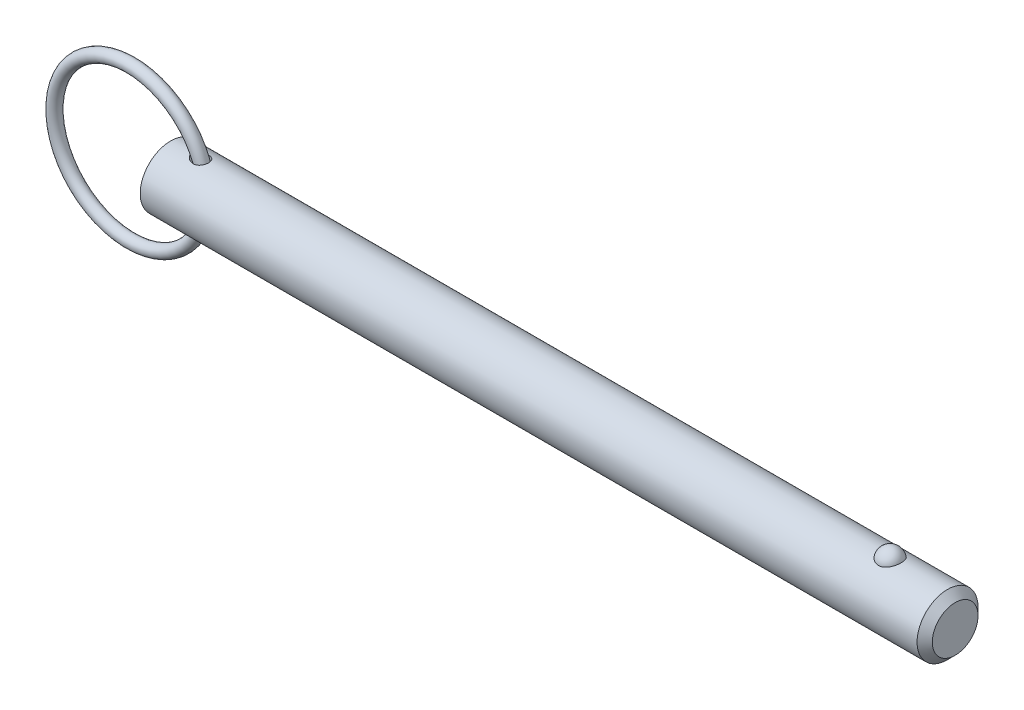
ISO-10303-21;
HEADER;
FILE_DESCRIPTION(('STEP AP214'),'2;1');
FILE_NAME('part.step','',(''),(''),'','','');
FILE_SCHEMA(('AUTOMOTIVE_DESIGN { 1 0 10303 214 1 1 1 1 }'));
ENDSEC;
DATA;
#1=APPLICATION_CONTEXT('core data for automotive mechanical design processes');
#2=APPLICATION_PROTOCOL_DEFINITION('international standard','automotive_design',2000,#1);
#3=PRODUCT_CONTEXT('',#1,'mechanical');
#4=PRODUCT('Part','Part','',(#3));
#5=PRODUCT_RELATED_PRODUCT_CATEGORY('part','',(#4));
#6=PRODUCT_DEFINITION_FORMATION('','',#4);
#7=PRODUCT_DEFINITION_CONTEXT('part definition',#1,'design');
#8=PRODUCT_DEFINITION('design','',#6,#7);
#9=PRODUCT_DEFINITION_SHAPE('','',#8);
#10=(LENGTH_UNIT() NAMED_UNIT(*) SI_UNIT(.MILLI.,.METRE.));
#11=(NAMED_UNIT(*) PLANE_ANGLE_UNIT() SI_UNIT($,.RADIAN.));
#12=(NAMED_UNIT(*) SI_UNIT($,.STERADIAN.) SOLID_ANGLE_UNIT());
#13=UNCERTAINTY_MEASURE_WITH_UNIT(LENGTH_MEASURE(1.E-05),#10,'distance_accuracy_value','');
#14=(GEOMETRIC_REPRESENTATION_CONTEXT(3) GLOBAL_UNCERTAINTY_ASSIGNED_CONTEXT((#13)) GLOBAL_UNIT_ASSIGNED_CONTEXT((#10,
#11,#12)) REPRESENTATION_CONTEXT('',''));
#15=CARTESIAN_POINT('',(0.,0.,0.));
#16=DIRECTION('',(0.,0.,1.));
#17=DIRECTION('',(1.,0.,0.));
#18=AXIS2_PLACEMENT_3D('',#15,#16,#17);
#19=CARTESIAN_POINT('',(-8.34703434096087,0.,0.));
#20=DIRECTION('',(0.,0.,1.));
#21=DIRECTION('',(1.,0.,0.));
#22=AXIS2_PLACEMENT_3D('',#19,#20,#21);
#23=TOROIDAL_SURFACE('',#22,15.875,1.27);
#24=CARTESIAN_POINT('',(8.79796565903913,0.,0.));
#25=VERTEX_POINT('',#24);
#26=VERTEX_LOOP('',#25);
#27=FACE_BOUND('',#26,.T.);
#28=ADVANCED_FACE('P0_F12',(#27),#23,.T.);
#29=CLOSED_SHELL('',(#28));
#30=MANIFOLD_SOLID_BREP('P0_B1',#29);
#31=CARTESIAN_POINT('',(0.,0.,0.));
#32=DIRECTION('',(1.,0.,0.));
#33=DIRECTION('',(0.,0.,-1.));
#34=AXIS2_PLACEMENT_3D('',#31,#32,#33);
#35=CYLINDRICAL_SURFACE('',#34,6.35);
#36=CARTESIAN_POINT('',(4.87230670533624,6.27273159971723,-0.987592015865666));
#37=CARTESIAN_POINT('',(4.94734735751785,6.26035058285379,-1.06623378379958));
#38=CARTESIAN_POINT('',(5.02968768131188,6.24755813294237,-1.13788608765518));
#39=CARTESIAN_POINT('',(5.20534267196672,6.22278258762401,-1.26640223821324));
#40=CARTESIAN_POINT('',(5.29867273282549,6.21080066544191,-1.32324497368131));
#41=CARTESIAN_POINT('',(5.49318962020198,6.18912414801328,-1.42117930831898));
#42=CARTESIAN_POINT('',(5.59435470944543,6.17942350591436,-1.46231273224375));
#43=CARTESIAN_POINT('',(5.80219659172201,6.16352555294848,-1.52793951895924));
#44=CARTESIAN_POINT('',(5.90887152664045,6.15732706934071,-1.55243845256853));
#45=CARTESIAN_POINT('',(6.12818220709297,6.14931784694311,-1.58387975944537));
#46=CARTESIAN_POINT('',(6.24090110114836,6.14763959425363,-1.59029227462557));
#47=CARTESIAN_POINT('',(6.46560233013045,6.14965588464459,-1.58248630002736));
#48=CARTESIAN_POINT('',(6.57758514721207,6.15334646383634,-1.56828303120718));
#49=CARTESIAN_POINT('',(6.78516594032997,6.1652116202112,-1.52091398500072));
#50=CARTESIAN_POINT('',(6.88126802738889,6.17288876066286,-1.48983713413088));
#51=CARTESIAN_POINT('',(7.06576629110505,6.19149190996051,-1.41052329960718));
#52=CARTESIAN_POINT('',(7.15416739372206,6.20241582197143,-1.36229738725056));
#53=CARTESIAN_POINT('',(7.3116692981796,6.2248616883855,-1.25548983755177));
#54=CARTESIAN_POINT('',(7.38181442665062,6.23621734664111,-1.19840625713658));
#55=CARTESIAN_POINT('',(7.51101296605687,6.259037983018,-1.07284763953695));
#56=CARTESIAN_POINT('',(7.5700684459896,6.2705029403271,-1.00437473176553));
#57=CARTESIAN_POINT('',(7.67374693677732,6.29184873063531,-0.860384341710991));
#58=CARTESIAN_POINT('',(7.71876694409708,6.30176816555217,-0.785157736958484));
#59=CARTESIAN_POINT('',(7.79574491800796,6.31935829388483,-0.628053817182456));
#60=CARTESIAN_POINT('',(7.82770308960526,6.32702902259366,-0.546176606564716));
#61=CARTESIAN_POINT('',(7.87788845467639,6.33930929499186,-0.377876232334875));
#62=CARTESIAN_POINT('',(7.8960810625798,6.34391112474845,-0.291442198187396));
#63=CARTESIAN_POINT('',(7.91820729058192,6.34953044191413,-0.116652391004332));
#64=CARTESIAN_POINT('',(7.92214044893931,6.35054781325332,-0.0282965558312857));
#65=CARTESIAN_POINT('',(7.91564686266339,6.34888556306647,0.14826357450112));
#66=CARTESIAN_POINT('',(7.9051533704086,6.34618875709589,0.236465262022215));
#67=CARTESIAN_POINT('',(7.86991530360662,6.33735741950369,0.409798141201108));
#68=CARTESIAN_POINT('',(7.84517062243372,6.33122286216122,0.494929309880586));
#69=CARTESIAN_POINT('',(7.78199851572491,6.31618517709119,0.659657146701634));
#70=CARTESIAN_POINT('',(7.74357645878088,6.30728313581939,0.739255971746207));
#71=CARTESIAN_POINT('',(7.65396632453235,6.28769050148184,0.890663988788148));
#72=CARTESIAN_POINT('',(7.60277911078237,6.27700002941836,0.962473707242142));
#73=CARTESIAN_POINT('',(7.48925881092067,6.2550822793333,1.09590260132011));
#74=CARTESIAN_POINT('',(7.42698604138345,6.24385813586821,1.15757361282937));
#75=CARTESIAN_POINT('',(7.29283556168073,6.2220655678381,1.26951234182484));
#76=CARTESIAN_POINT('',(7.22095880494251,6.21149707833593,1.31978118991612));
#77=CARTESIAN_POINT('',(7.06971853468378,6.19216002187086,1.40772509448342));
#78=CARTESIAN_POINT('',(6.99035873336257,6.18339056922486,1.44540635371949));
#79=CARTESIAN_POINT('',(6.826427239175,6.16851603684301,1.50762653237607));
#80=CARTESIAN_POINT('',(6.74185489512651,6.16241129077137,1.53216380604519));
#81=CARTESIAN_POINT('',(6.56686412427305,6.15321474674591,1.56869994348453));
#82=CARTESIAN_POINT('',(6.47634467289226,6.15023369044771,1.58023897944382));
#83=CARTESIAN_POINT('',(6.29456956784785,6.14778331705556,1.58974172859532));
#84=CARTESIAN_POINT('',(6.20331368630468,6.1483151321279,1.58770106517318));
#85=CARTESIAN_POINT('',(6.01385969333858,6.15284811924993,1.5700487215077));
#86=CARTESIAN_POINT('',(5.91578322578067,6.15715979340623,1.55322212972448));
#87=CARTESIAN_POINT('',(5.72331909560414,6.16902415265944,1.5054032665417));
#88=CARTESIAN_POINT('',(5.62893440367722,6.17657939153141,1.4743998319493));
#89=CARTESIAN_POINT('',(5.43572606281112,6.19502494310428,1.39499475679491));
#90=CARTESIAN_POINT('',(5.33755891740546,6.20619097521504,1.3450526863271));
#91=CARTESIAN_POINT('',(5.15090047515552,6.23006191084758,1.22975103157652));
#92=CARTESIAN_POINT('',(5.06240741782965,6.24276653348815,1.16439425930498));
#93=CARTESIAN_POINT('',(4.91171642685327,6.26607433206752,1.03083814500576));
#94=CARTESIAN_POINT('',(4.84758224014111,6.27668356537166,0.964825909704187));
#95=CARTESIAN_POINT('',(4.73090054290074,6.29683133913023,0.823112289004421));
#96=CARTESIAN_POINT('',(4.6783368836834,6.30637136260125,0.747424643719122));
#97=CARTESIAN_POINT('',(4.59543145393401,6.32183254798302,0.601150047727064));
#98=CARTESIAN_POINT('',(4.56283099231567,6.32809321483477,0.531883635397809));
#99=CARTESIAN_POINT('',(4.50941370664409,6.33849198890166,0.388778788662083));
#100=CARTESIAN_POINT('',(4.48858876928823,6.34263155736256,0.314943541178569));
#101=CARTESIAN_POINT('',(4.46008864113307,6.3483236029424,0.164282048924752));
#102=CARTESIAN_POINT('',(4.45247558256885,6.34986385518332,0.0874434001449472));
#103=CARTESIAN_POINT('',(4.45121096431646,6.35011863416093,-0.0663538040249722));
#104=CARTESIAN_POINT('',(4.45755802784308,6.34883343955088,-0.143312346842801));
#105=CARTESIAN_POINT('',(4.48267656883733,6.34380948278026,-0.288945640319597));
#106=CARTESIAN_POINT('',(4.50045680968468,6.34026665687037,-0.357802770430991));
#107=CARTESIAN_POINT('',(4.54636050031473,6.33128211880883,-0.49181574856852));
#108=CARTESIAN_POINT('',(4.57448566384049,6.32584009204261,-0.556970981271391));
#109=CARTESIAN_POINT('',(4.64209700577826,6.31308107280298,-0.687092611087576));
#110=CARTESIAN_POINT('',(4.68226903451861,6.30565525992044,-0.75168940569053));
#111=CARTESIAN_POINT('',(4.77120834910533,6.28979741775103,-0.874524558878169));
#112=CARTESIAN_POINT('',(4.81998302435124,6.28136452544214,-0.932757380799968));
#113=CARTESIAN_POINT('',(4.87230670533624,6.27273159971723,-0.987592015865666));
#114=B_SPLINE_CURVE_WITH_KNOTS('',3,(#36,#37,#38,#39,#40,#41,#42,#43,#44,#45,#46,#47,#48,#49,
#50,#51,#52,#53,#54,#55,#56,#57,#58,#59,#60,#61,#62,#63,#64,#65,#66,#67,#68,#69,#70,#71,#72,#73,
#74,#75,#76,#77,#78,#79,#80,#81,#82,#83,#84,#85,#86,#87,#88,#89,#90,#91,#92,#93,#94,#95,#96,#97,
#98,#99,#100,#101,#102,#103,#104,#105,#106,#107,#108,#109,#110,#111,#112,#113),.UNSPECIFIED.,
.T.,.F.,(4,2,2,2,2,2,2,2,2,2,2,2,2,2,2,2,2,2,2,2,2,2,2,2,2,2,2,2,2,2,2,2,2,2,2,2,2,2,4),(0.,
0.327902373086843,0.65626964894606,0.98375647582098,1.31113357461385,1.64800657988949,
1.98463099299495,2.28681225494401,2.58879878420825,2.86088594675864,3.13292229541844,
3.39636481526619,3.65980320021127,3.92390128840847,4.18800792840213,4.45334062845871,
4.7186753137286,4.98390596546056,5.24911867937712,5.51293017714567,5.7767155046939,
6.04037065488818,6.30405880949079,6.57680801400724,6.84964512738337,7.14724526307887,
7.44508014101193,7.77572668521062,8.10631295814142,8.38318772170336,8.65967357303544,
8.8891530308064,9.11847418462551,9.34887088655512,9.57924486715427,9.79193291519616,
10.0046562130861,10.2330958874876,10.4617327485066),.UNSPECIFIED.);
#115=CARTESIAN_POINT('',(4.87230670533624,6.27273159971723,-0.987592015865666));
#116=VERTEX_POINT('',#115);
#117=EDGE_CURVE('P1_E40',#116,#116,#114,.T.);
#118=ORIENTED_EDGE('',*,*,#117,.T.);
#119=EDGE_LOOP('',(#118));
#120=FACE_BOUND('',#119,.T.);
#121=CARTESIAN_POINT('',(161.9125,0.,0.));
#122=DIRECTION('',(1.,0.,0.));
#123=DIRECTION('',(0.,0.,-1.));
#124=AXIS2_PLACEMENT_3D('',#121,#122,#123);
#125=CIRCLE('',#124,6.35);
#126=CARTESIAN_POINT('',(161.9125,0.,-6.35));
#127=VERTEX_POINT('',#126);
#128=EDGE_CURVE('P1_E25',#127,#127,#125,.T.);
#129=ORIENTED_EDGE('',*,*,#128,.F.);
#130=EDGE_LOOP('',(#129));
#131=FACE_BOUND('',#130,.T.);
#132=CARTESIAN_POINT('',(0.,0.,0.));
#133=DIRECTION('',(1.,0.,0.));
#134=DIRECTION('',(0.,0.,-1.));
#135=AXIS2_PLACEMENT_3D('',#132,#133,#134);
#136=CIRCLE('',#135,6.35);
#137=CARTESIAN_POINT('',(0.,0.,-6.35));
#138=VERTEX_POINT('',#137);
#139=EDGE_CURVE('P1_E9',#138,#138,#136,.T.);
#140=ORIENTED_EDGE('',*,*,#139,.T.);
#141=EDGE_LOOP('',(#140));
#142=FACE_BOUND('',#141,.T.);
#143=CARTESIAN_POINT('',(149.950021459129,5.87502187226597,2.40969251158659));
#144=CARTESIAN_POINT('',(149.825030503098,5.87501645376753,2.40969773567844));
#145=CARTESIAN_POINT('',(149.700080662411,5.87916061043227,2.39967292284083));
#146=CARTESIAN_POINT('',(149.453909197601,5.8952311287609,2.35991730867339));
#147=CARTESIAN_POINT('',(149.332686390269,5.90715499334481,2.33019283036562));
#148=CARTESIAN_POINT('',(149.097517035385,5.93739567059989,2.25201402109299));
#149=CARTESIAN_POINT('',(148.983560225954,5.95570321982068,2.20358681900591));
#150=CARTESIAN_POINT('',(148.76557352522,5.99672067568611,2.08937987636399));
#151=CARTESIAN_POINT('',(148.661545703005,6.01943149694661,2.02359652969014));
#152=CARTESIAN_POINT('',(148.462943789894,6.06760647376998,1.87428969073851));
#153=CARTESIAN_POINT('',(148.368726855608,6.09313095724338,1.79031110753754));
#154=CARTESIAN_POINT('',(148.195255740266,6.14375873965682,1.60800178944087));
#155=CARTESIAN_POINT('',(148.116004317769,6.16886196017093,1.50966841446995));
#156=CARTESIAN_POINT('',(147.970845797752,6.21724600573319,1.29645884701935));
#157=CARTESIAN_POINT('',(147.905688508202,6.24039621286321,1.18104158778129));
#158=CARTESIAN_POINT('',(147.794703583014,6.28117277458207,0.940351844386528));
#159=CARTESIAN_POINT('',(147.748877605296,6.29879865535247,0.815078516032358));
#160=CARTESIAN_POINT('',(147.677023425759,6.32692073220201,0.55649439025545));
#161=CARTESIAN_POINT('',(147.651249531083,6.33732517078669,0.42310277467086));
#162=CARTESIAN_POINT('',(147.620988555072,6.34957673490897,0.153542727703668));
#163=CARTESIAN_POINT('',(147.616500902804,6.35142408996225,0.0173743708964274));
#164=CARTESIAN_POINT('',(147.628865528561,6.34638925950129,-0.253036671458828));
#165=CARTESIAN_POINT('',(147.645594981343,6.33955731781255,-0.387285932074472));
#166=CARTESIAN_POINT('',(147.699843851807,6.31794129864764,-0.650851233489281));
#167=CARTESIAN_POINT('',(147.737363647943,6.30315707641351,-0.7801671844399));
#168=CARTESIAN_POINT('',(147.832500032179,6.26711642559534,-1.03041949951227));
#169=CARTESIAN_POINT('',(147.890143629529,6.24585130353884,-1.1513443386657));
#170=CARTESIAN_POINT('',(148.024352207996,6.19905619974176,-1.38129800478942));
#171=CARTESIAN_POINT('',(148.100918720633,6.17352587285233,-1.49032586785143));
#172=CARTESIAN_POINT('',(148.271753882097,6.12080227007,-1.69393164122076));
#173=CARTESIAN_POINT('',(148.366100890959,6.09360200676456,-1.78844209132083));
#174=CARTESIAN_POINT('',(148.570119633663,6.04070434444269,-1.95970536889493));
#175=CARTESIAN_POINT('',(148.679790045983,6.01500681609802,-2.03645972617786));
#176=CARTESIAN_POINT('',(148.909187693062,5.96867714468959,-2.1684564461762));
#177=CARTESIAN_POINT('',(149.028652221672,5.94794910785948,-2.2241206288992));
#178=CARTESIAN_POINT('',(149.276218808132,5.91340580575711,-2.31440992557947));
#179=CARTESIAN_POINT('',(149.404317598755,5.8995879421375,-2.3490429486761));
#180=CARTESIAN_POINT('',(149.658582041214,5.88111049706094,-2.39491590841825));
#181=CARTESIAN_POINT('',(149.784520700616,5.876025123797,-2.40724512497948));
#182=CARTESIAN_POINT('',(150.036786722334,5.87428980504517,-2.41147867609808));
#183=CARTESIAN_POINT('',(150.163114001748,5.87763817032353,-2.40338710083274));
#184=CARTESIAN_POINT('',(150.408417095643,5.89212921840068,-2.36762715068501));
#185=CARTESIAN_POINT('',(150.527499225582,5.90302431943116,-2.34058030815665));
#186=CARTESIAN_POINT('',(150.75924472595,5.93113752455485,-2.26839066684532));
#187=CARTESIAN_POINT('',(150.871907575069,5.94835614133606,-2.22324640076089));
#188=CARTESIAN_POINT('',(151.090400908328,5.98773016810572,-2.11493806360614));
#189=CARTESIAN_POINT('',(151.196028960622,6.00998499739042,-2.05140269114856));
#190=CARTESIAN_POINT('',(151.395300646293,6.05690144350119,-1.90842705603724));
#191=CARTESIAN_POINT('',(151.488941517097,6.08156361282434,-1.82898313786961));
#192=CARTESIAN_POINT('',(151.666675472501,6.13211715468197,-1.65182429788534));
#193=CARTESIAN_POINT('',(151.750055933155,6.15800825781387,-1.55339381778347));
#194=CARTESIAN_POINT('',(151.899790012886,6.20712834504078,-1.34374214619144));
#195=CARTESIAN_POINT('',(151.966140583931,6.23035685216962,-1.23251867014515));
#196=CARTESIAN_POINT('',(152.082345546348,6.27251177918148,-0.996447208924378));
#197=CARTESIAN_POINT('',(152.131607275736,6.29127762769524,-0.871278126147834));
#198=CARTESIAN_POINT('',(152.209614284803,6.3215862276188,-0.613870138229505));
#199=CARTESIAN_POINT('',(152.238359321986,6.33312889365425,-0.481631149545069));
#200=CARTESIAN_POINT('',(152.27477058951,6.34782349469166,-0.213672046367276));
#201=CARTESIAN_POINT('',(152.282413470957,6.35096613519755,-0.0779482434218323));
#202=CARTESIAN_POINT('',(152.276395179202,6.34851322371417,0.192943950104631));
#203=CARTESIAN_POINT('',(152.262734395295,6.3429178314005,0.328112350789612));
#204=CARTESIAN_POINT('',(152.21450361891,6.32360512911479,0.593406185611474));
#205=CARTESIAN_POINT('',(152.180031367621,6.30992579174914,0.723552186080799));
#206=CARTESIAN_POINT('',(152.090953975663,6.27586325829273,0.975834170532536));
#207=CARTESIAN_POINT('',(152.03634761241,6.25547965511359,1.09796966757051));
#208=CARTESIAN_POINT('',(151.90775879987,6.20998183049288,1.33148921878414));
#209=CARTESIAN_POINT('',(151.833674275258,6.18484288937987,1.44281227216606));
#210=CARTESIAN_POINT('',(151.667820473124,6.13258735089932,1.65087683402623));
#211=CARTESIAN_POINT('',(151.576051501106,6.10547078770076,1.74761859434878));
#212=CARTESIAN_POINT('',(151.377183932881,6.05235879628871,1.92350926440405));
#213=CARTESIAN_POINT('',(151.270133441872,6.02636017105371,2.00271146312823));
#214=CARTESIAN_POINT('',(151.043138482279,5.97843747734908,2.1415415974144));
#215=CARTESIAN_POINT('',(150.923191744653,5.95651412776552,2.20116608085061));
#216=CARTESIAN_POINT('',(150.664523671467,5.91812106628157,2.30250570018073));
#217=CARTESIAN_POINT('',(150.52506980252,5.90217533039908,2.34256795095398));
#218=CARTESIAN_POINT('',(150.240397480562,5.88063128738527,2.39615214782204));
#219=CARTESIAN_POINT('',(150.09518174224,5.8750281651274,2.40968644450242));
#220=CARTESIAN_POINT('',(149.950021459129,5.87502187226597,2.40969251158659));
#221=B_SPLINE_CURVE_WITH_KNOTS('',3,(#143,#144,#145,#146,#147,#148,#149,#150,#151,#152,#153,
#154,#155,#156,#157,#158,#159,#160,#161,#162,#163,#164,#165,#166,#167,#168,#169,#170,#171,#172,
#173,#174,#175,#176,#177,#178,#179,#180,#181,#182,#183,#184,#185,#186,#187,#188,#189,#190,#191,
#192,#193,#194,#195,#196,#197,#198,#199,#200,#201,#202,#203,#204,#205,#206,#207,#208,#209,#210,
#211,#212,#213,#214,#215,#216,#217,#218,#219,#220),.UNSPECIFIED.,.T.,.F.,(4,2,2,2,2,2,2,2,2,2,2,
2,2,2,2,2,2,2,2,2,2,2,2,2,2,2,2,2,2,2,2,2,2,2,2,2,2,2,4),(0.,0.374440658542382,
0.748761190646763,1.12254078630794,1.49639810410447,1.88098871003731,2.2656501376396,
2.6674110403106,3.06920639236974,3.47601794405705,3.88281858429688,4.28727498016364,
4.69173873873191,5.09674745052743,5.50178895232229,5.9086591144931,6.31549420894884,
6.71369855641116,7.11175305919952,7.48978077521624,7.86773278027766,8.2338388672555,
8.59997464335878,8.97409044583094,9.34829231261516,9.74122667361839,10.1342313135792,
10.5397522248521,10.9452779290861,11.3512521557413,11.7572189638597,12.1612938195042,
12.5653932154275,12.9716540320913,13.3779078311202,13.7829098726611,14.1879832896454,
14.6230486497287,15.0579114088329),.UNSPECIFIED.);
#222=CARTESIAN_POINT('',(149.950021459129,5.87502187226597,2.40969251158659));
#223=VERTEX_POINT('',#222);
#224=EDGE_CURVE('P1_E34',#223,#223,#221,.T.);
#225=ORIENTED_EDGE('',*,*,#224,.T.);
#226=EDGE_LOOP('',(#225));
#227=FACE_BOUND('',#226,.T.);
#228=CARTESIAN_POINT('',(4.87230670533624,-6.27273159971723,-0.987592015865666));
#229=CARTESIAN_POINT('',(4.81440819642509,-6.28228431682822,-0.926913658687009));
#230=CARTESIAN_POINT('',(4.76085022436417,-6.29159289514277,-0.862071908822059));
#231=CARTESIAN_POINT('',(4.66448472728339,-6.3088950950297,-0.724655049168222));
#232=CARTESIAN_POINT('',(4.62166818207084,-6.31688981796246,-0.652086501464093));
#233=CARTESIAN_POINT('',(4.54882773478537,-6.33076917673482,-0.499747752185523));
#234=CARTESIAN_POINT('',(4.51891553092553,-6.33663532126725,-0.419921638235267));
#235=CARTESIAN_POINT('',(4.4747692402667,-6.3453711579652,-0.255882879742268));
#236=CARTESIAN_POINT('',(4.4605188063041,-6.34824397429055,-0.171674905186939));
#237=CARTESIAN_POINT('',(4.44966179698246,-6.35043041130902,-0.012076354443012));
#238=CARTESIAN_POINT('',(4.45117530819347,-6.35012328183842,0.063184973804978));
#239=CARTESIAN_POINT('',(4.46726452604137,-6.34689000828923,0.212230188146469));
#240=CARTESIAN_POINT('',(4.48184026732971,-6.3439638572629,0.286014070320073));
#241=CARTESIAN_POINT('',(4.52202068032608,-6.33603071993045,0.426550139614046));
#242=CARTESIAN_POINT('',(4.54707079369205,-6.33112875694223,0.493469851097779));
#243=CARTESIAN_POINT('',(4.60669855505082,-6.31972370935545,0.622743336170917));
#244=CARTESIAN_POINT('',(4.64127887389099,-6.31322017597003,0.685095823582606));
#245=CARTESIAN_POINT('',(4.7232814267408,-6.29826068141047,0.811769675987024));
#246=CARTESIAN_POINT('',(4.77176118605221,-6.28966287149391,0.87538636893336));
#247=CARTESIAN_POINT('',(4.87703902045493,-6.27182325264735,0.995192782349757));
#248=CARTESIAN_POINT('',(4.93384225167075,-6.26258104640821,1.05137785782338));
#249=CARTESIAN_POINT('',(5.06617436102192,-6.24228878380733,1.16635591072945));
#250=CARTESIAN_POINT('',(5.14318167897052,-6.23124423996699,1.22345054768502));
#251=CARTESIAN_POINT('',(5.3047576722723,-6.21023402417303,1.32598441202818));
#252=CARTESIAN_POINT('',(5.38933237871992,-6.20026922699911,1.37141422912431));
#253=CARTESIAN_POINT('',(5.57760134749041,-6.18099350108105,1.45601817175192));
#254=CARTESIAN_POINT('',(5.68224348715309,-6.17201456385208,1.4931788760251));
#255=CARTESIAN_POINT('',(5.89649087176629,-6.15800474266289,1.5499484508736));
#256=CARTESIAN_POINT('',(6.00609708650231,-6.15297463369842,1.56955387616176));
#257=CARTESIAN_POINT('',(6.22752772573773,-6.14779725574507,1.58971993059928));
#258=CARTESIAN_POINT('',(6.33935715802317,-6.14766266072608,1.59023112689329));
#259=CARTESIAN_POINT('',(6.56108231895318,-6.15269227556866,1.57066564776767));
#260=CARTESIAN_POINT('',(6.67097982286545,-6.15785133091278,1.55060899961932));
#261=CARTESIAN_POINT('',(6.87257705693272,-6.17211580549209,1.4927326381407));
#262=CARTESIAN_POINT('',(6.96494608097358,-6.18072242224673,1.45711948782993));
#263=CARTESIAN_POINT('',(7.14129343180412,-6.20069920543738,1.36960980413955));
#264=CARTESIAN_POINT('',(7.22527609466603,-6.21206793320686,1.31772174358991));
#265=CARTESIAN_POINT('',(7.37471505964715,-6.23497047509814,1.20443359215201));
#266=CARTESIAN_POINT('',(7.44115811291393,-6.24639757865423,1.14430788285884));
#267=CARTESIAN_POINT('',(7.56261868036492,-6.26896339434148,1.0134084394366));
#268=CARTESIAN_POINT('',(7.61763801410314,-6.28010215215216,0.942636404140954));
#269=CARTESIAN_POINT('',(7.71360563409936,-6.30055923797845,0.794304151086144));
#270=CARTESIAN_POINT('',(7.75485562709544,-6.3099143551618,0.716943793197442));
#271=CARTESIAN_POINT('',(7.82406051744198,-6.32610528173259,0.556244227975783));
#272=CARTESIAN_POINT('',(7.85201540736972,-6.33294108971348,0.472905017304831));
#273=CARTESIAN_POINT('',(7.89408663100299,-6.34338077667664,0.302249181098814));
#274=CARTESIAN_POINT('',(7.90814615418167,-6.34697138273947,0.214917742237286));
#275=CARTESIAN_POINT('',(7.92192329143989,-6.35048887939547,0.0390564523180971));
#276=CARTESIAN_POINT('',(7.92164046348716,-6.3504156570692,-0.0494734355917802));
#277=CARTESIAN_POINT('',(7.9067075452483,-6.34660520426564,-0.225592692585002));
#278=CARTESIAN_POINT('',(7.89199989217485,-6.34285329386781,-0.313176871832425));
#279=CARTESIAN_POINT('',(7.84845340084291,-6.33206809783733,-0.484549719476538));
#280=CARTESIAN_POINT('',(7.8196145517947,-6.32503480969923,-0.568338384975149));
#281=CARTESIAN_POINT('',(7.74850591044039,-6.30846389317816,-0.729625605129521));
#282=CARTESIAN_POINT('',(7.70625193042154,-6.29892921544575,-0.807131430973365));
#283=CARTESIAN_POINT('',(7.60933437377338,-6.27840608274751,-0.953731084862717));
#284=CARTESIAN_POINT('',(7.55467181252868,-6.2674177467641,-1.02282560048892));
#285=CARTESIAN_POINT('',(7.43471786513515,-6.24527869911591,-1.15028913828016));
#286=CARTESIAN_POINT('',(7.36948829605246,-6.23412925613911,-1.20871657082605));
#287=CARTESIAN_POINT('',(7.23001723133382,-6.21283678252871,-1.3137894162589));
#288=CARTESIAN_POINT('',(7.15577649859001,-6.20269366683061,-1.36043582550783));
#289=CARTESIAN_POINT('',(7.00025986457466,-6.18446636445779,-1.44103993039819));
#290=CARTESIAN_POINT('',(6.91896776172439,-6.17638709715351,-1.47496739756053));
#291=CARTESIAN_POINT('',(6.75184232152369,-6.16309237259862,-1.52957024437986));
#292=CARTESIAN_POINT('',(6.6660081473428,-6.15787744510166,-1.55024317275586));
#293=CARTESIAN_POINT('',(6.48842585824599,-6.15055064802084,-1.57906962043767));
#294=CARTESIAN_POINT('',(6.39658108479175,-6.14857915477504,-1.58665744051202));
#295=CARTESIAN_POINT('',(6.21279832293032,-6.14817707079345,-1.58821048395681));
#296=CARTESIAN_POINT('',(6.12086031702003,-6.14974736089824,-1.58217231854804));
#297=CARTESIAN_POINT('',(5.92996902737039,-6.15640095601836,-1.55609403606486));
#298=CARTESIAN_POINT('',(5.83120653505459,-6.16181208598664,-1.53474519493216));
#299=CARTESIAN_POINT('',(5.63804881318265,-6.17573474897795,-1.47771859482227));
#300=CARTESIAN_POINT('',(5.54365953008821,-6.18425037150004,-1.44202192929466));
#301=CARTESIAN_POINT('',(5.34413923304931,-6.20522938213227,-1.34918979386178));
#302=CARTESIAN_POINT('',(5.24033140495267,-6.21813417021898,-1.28928337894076));
#303=CARTESIAN_POINT('',(5.0455423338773,-6.24510162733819,-1.15156760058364));
#304=CARTESIAN_POINT('',(4.95454590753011,-6.25916289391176,-1.07377972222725));
#305=CARTESIAN_POINT('',(4.87230670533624,-6.27273159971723,-0.987592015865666));
#306=B_SPLINE_CURVE_WITH_KNOTS('',3,(#228,#229,#230,#231,#232,#233,#234,#235,#236,#237,#238,
#239,#240,#241,#242,#243,#244,#245,#246,#247,#248,#249,#250,#251,#252,#253,#254,#255,#256,#257,
#258,#259,#260,#261,#262,#263,#264,#265,#266,#267,#268,#269,#270,#271,#272,#273,#274,#275,#276,
#277,#278,#279,#280,#281,#282,#283,#284,#285,#286,#287,#288,#289,#290,#291,#292,#293,#294,#295,
#296,#297,#298,#299,#300,#301,#302,#303,#304,#305),.UNSPECIFIED.,.T.,.F.,(4,2,2,2,2,2,2,2,2,2,2,
2,2,2,2,2,2,2,2,2,2,2,2,2,2,2,2,2,2,2,2,2,2,2,2,2,2,2,4),(0.,0.252951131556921,0.50568912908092,
0.760572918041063,1.01519041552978,1.23982791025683,1.46446600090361,1.67847364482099,
1.89254132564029,2.13299551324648,2.37359928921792,2.6619896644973,2.95061196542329,
3.28329078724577,3.61603488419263,3.94964035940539,4.282921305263,4.57939201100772,
4.87570862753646,5.14538810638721,5.4150245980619,5.67829123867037,5.94155802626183,
6.20589676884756,6.47024365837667,6.73564974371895,7.00105603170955,7.26615064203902,
7.53122356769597,7.79479837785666,8.05835088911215,8.32252586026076,8.58674967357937,
8.86213419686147,9.137587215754,9.43991696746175,9.74264642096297,10.1023688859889,
10.461661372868),.UNSPECIFIED.);
#307=CARTESIAN_POINT('',(4.87230670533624,-6.27273159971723,-0.987592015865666));
#308=VERTEX_POINT('',#307);
#309=EDGE_CURVE('P1_E17',#308,#308,#306,.T.);
#310=ORIENTED_EDGE('',*,*,#309,.T.);
#311=EDGE_LOOP('',(#310));
#312=FACE_BOUND('',#311,.T.);
#313=ADVANCED_FACE('P1_F13',(#120,#131,#142,#227,#312),#35,.T.);
#314=CARTESIAN_POINT('',(0.,0.,0.));
#315=DIRECTION('',(-1.,0.,0.));
#316=DIRECTION('',(0.,0.,1.));
#317=AXIS2_PLACEMENT_3D('',#314,#315,#316);
#318=PLANE('',#317);
#319=ORIENTED_EDGE('',*,*,#139,.F.);
#320=EDGE_LOOP('',(#319));
#321=FACE_BOUND('',#320,.T.);
#322=ADVANCED_FACE('P1_F15',(#321),#318,.T.);
#323=CARTESIAN_POINT('',(163.5,0.,0.));
#324=DIRECTION('',(-1.,0.,0.));
#325=DIRECTION('',(0.,0.,1.));
#326=AXIS2_PLACEMENT_3D('',#323,#324,#325);
#327=CONICAL_SURFACE('',#326,4.76250000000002,0.785398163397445);
#328=ORIENTED_EDGE('',*,*,#128,.T.);
#329=EDGE_LOOP('',(#328));
#330=FACE_BOUND('',#329,.T.);
#331=CARTESIAN_POINT('',(163.5,0.,0.));
#332=DIRECTION('',(1.,0.,0.));
#333=DIRECTION('',(0.,0.,-1.));
#334=AXIS2_PLACEMENT_3D('',#331,#332,#333);
#335=CIRCLE('',#334,4.76250000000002);
#336=CARTESIAN_POINT('',(163.5,0.,-4.76250000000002));
#337=VERTEX_POINT('',#336);
#338=EDGE_CURVE('P1_E30',#337,#337,#335,.T.);
#339=ORIENTED_EDGE('',*,*,#338,.F.);
#340=EDGE_LOOP('',(#339));
#341=FACE_BOUND('',#340,.T.);
#342=ADVANCED_FACE('P1_F55',(#330,#341),#327,.T.);
#343=CARTESIAN_POINT('',(163.5,4.76250000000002,0.));
#344=DIRECTION('',(1.,0.,0.));
#345=DIRECTION('',(0.,0.,-1.));
#346=AXIS2_PLACEMENT_3D('',#343,#344,#345);
#347=PLANE('',#346);
#348=ORIENTED_EDGE('',*,*,#338,.T.);
#349=EDGE_LOOP('',(#348));
#350=FACE_BOUND('',#349,.T.);
#351=ADVANCED_FACE('P1_F51',(#350),#347,.T.);
#352=CARTESIAN_POINT('',(149.950021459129,5.715,0.));
#353=DIRECTION('',(-1.,0.,0.));
#354=DIRECTION('',(0.,1.,0.));
#355=AXIS2_PLACEMENT_3D('',#352,#353,#354);
#356=SPHERICAL_SURFACE('',#355,2.415);
#357=ORIENTED_EDGE('',*,*,#224,.F.);
#358=EDGE_LOOP('',(#357));
#359=FACE_BOUND('',#358,.T.);
#360=ADVANCED_FACE('P1_F46',(#359),#356,.T.);
#361=CARTESIAN_POINT('',(-8.34703434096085,0.,0.));
#362=DIRECTION('',(0.,0.,1.));
#363=DIRECTION('',(1.,0.,0.));
#364=AXIS2_PLACEMENT_3D('',#361,#362,#363);
#365=TOROIDAL_SURFACE('',#364,15.875,1.5875);
#366=ORIENTED_EDGE('',*,*,#309,.F.);
#367=EDGE_LOOP('',(#366));
#368=FACE_BOUND('',#367,.T.);
#369=ORIENTED_EDGE('',*,*,#117,.F.);
#370=EDGE_LOOP('',(#369));
#371=FACE_BOUND('',#370,.T.);
#372=ADVANCED_FACE('P1_F50',(#368,#371),#365,.F.);
#373=CLOSED_SHELL('',(#313,#322,#342,#351,#360,#372));
#374=MANIFOLD_SOLID_BREP('P1_B1',#373);
#375=ADVANCED_BREP_SHAPE_REPRESENTATION('',(#18,#30,#374),#14);
#376=SHAPE_DEFINITION_REPRESENTATION(#9,#375);
ENDSEC;
END-ISO-10303-21;
